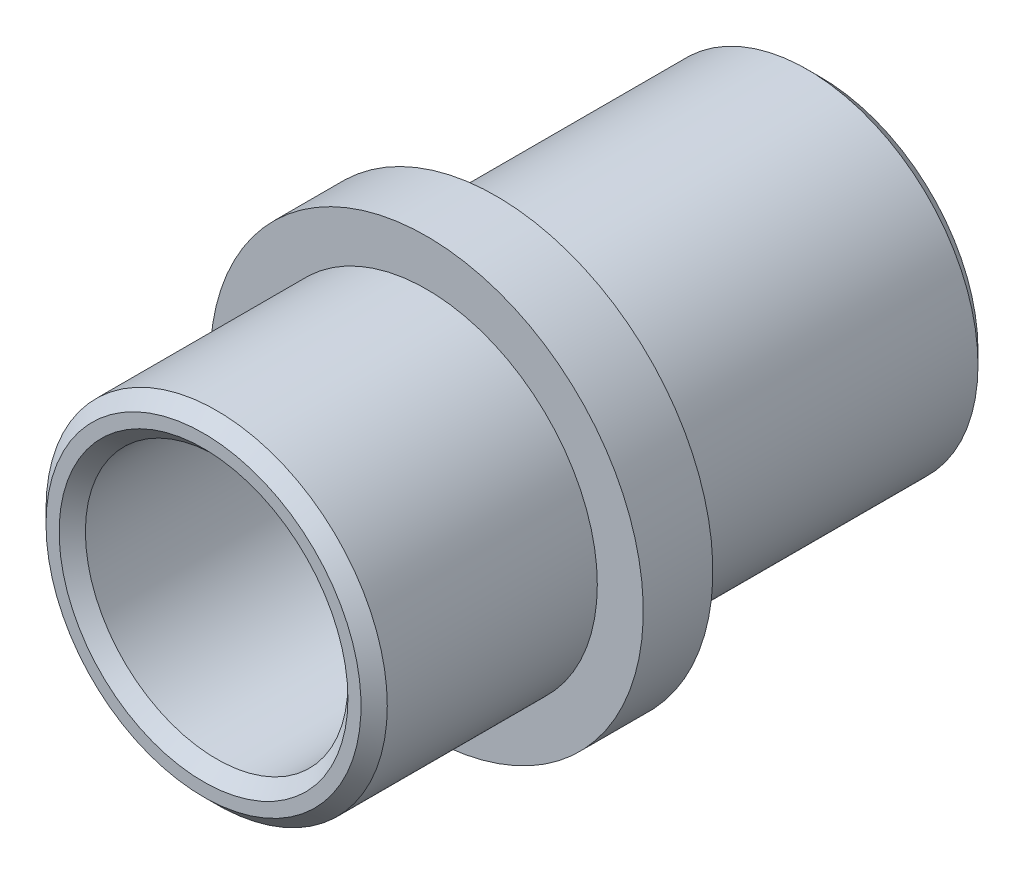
from build123d import *

# Parameters (mm, degrees)
ESQUISSE1_R      = 13
ESQUISSE1_R_2    = 10
EXTRUSION1_DEPTH = 47
ESQUISSE2_R      = 16.5
ESQUISSE2_R_2    = 10
EXTRUSION2_DEPTH = 5.3
CHANFREIN1_SIZE  = 1


with BuildPart() as part:
    # Esquisse1 → Extrusion1 (new body)
    with BuildSketch(Plane.XY):
        Circle(ESQUISSE1_R)
        Circle(ESQUISSE1_R_2, mode=Mode.SUBTRACT)
    extrude(amount=EXTRUSION1_DEPTH)

    # Esquisse2 → Extrusion2 (add)
    with BuildSketch(Plane.XY.offset(24.7)):
        Circle(ESQUISSE2_R)
        Circle(ESQUISSE2_R_2, mode=Mode.SUBTRACT)
    extrude(amount=EXTRUSION2_DEPTH)

    # Chanfrein1
    chanfrein1_edges = [part.edges().sort_by_distance(p)[0] for p in [
        (-13, 0, 0),
        (-13, 0, 47),
        (-10, 0, 0),
        (-10, 0, 47),
    ]]
    chamfer(chanfrein1_edges, length=CHANFREIN1_SIZE)


solid = part.part
